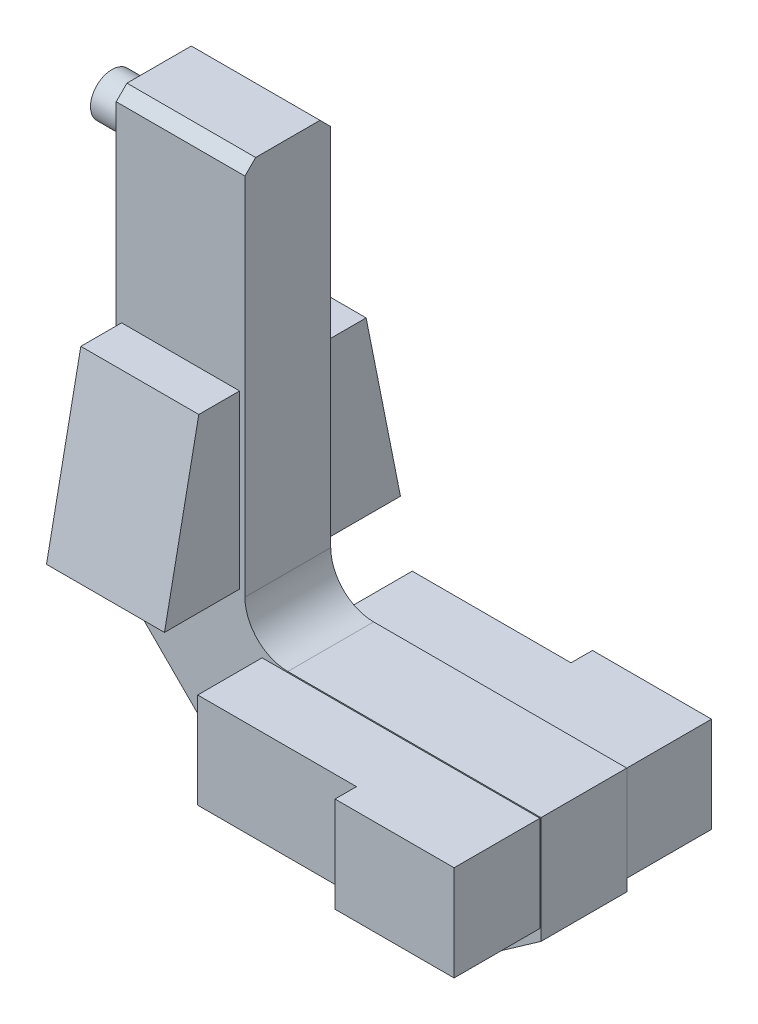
ISO-10303-21;
HEADER;
FILE_DESCRIPTION(('STEP AP214'),'2;1');
FILE_NAME('part.step','',(''),(''),'','','');
FILE_SCHEMA(('AUTOMOTIVE_DESIGN { 1 0 10303 214 1 1 1 1 }'));
ENDSEC;
DATA;
#1=APPLICATION_CONTEXT('core data for automotive mechanical design processes');
#2=APPLICATION_PROTOCOL_DEFINITION('international standard','automotive_design',2000,#1);
#3=PRODUCT_CONTEXT('',#1,'mechanical');
#4=PRODUCT('Part','Part','',(#3));
#5=PRODUCT_RELATED_PRODUCT_CATEGORY('part','',(#4));
#6=PRODUCT_DEFINITION_FORMATION('','',#4);
#7=PRODUCT_DEFINITION_CONTEXT('part definition',#1,'design');
#8=PRODUCT_DEFINITION('design','',#6,#7);
#9=PRODUCT_DEFINITION_SHAPE('','',#8);
#10=(LENGTH_UNIT() NAMED_UNIT(*) SI_UNIT(.MILLI.,.METRE.));
#11=(NAMED_UNIT(*) PLANE_ANGLE_UNIT() SI_UNIT($,.RADIAN.));
#12=(NAMED_UNIT(*) SI_UNIT($,.STERADIAN.) SOLID_ANGLE_UNIT());
#13=UNCERTAINTY_MEASURE_WITH_UNIT(LENGTH_MEASURE(1.E-05),#10,'distance_accuracy_value','');
#14=(GEOMETRIC_REPRESENTATION_CONTEXT(3) GLOBAL_UNCERTAINTY_ASSIGNED_CONTEXT((#13)) GLOBAL_UNIT_ASSIGNED_CONTEXT((#10,
#11,#12)) REPRESENTATION_CONTEXT('',''));
#15=CARTESIAN_POINT('',(0.,0.,0.));
#16=DIRECTION('',(0.,0.,1.));
#17=DIRECTION('',(1.,0.,0.));
#18=AXIS2_PLACEMENT_3D('',#15,#16,#17);
#19=CARTESIAN_POINT('',(0.,0.,20.));
#20=DIRECTION('',(0.,0.,1.));
#21=DIRECTION('',(1.,0.,0.));
#22=AXIS2_PLACEMENT_3D('',#19,#20,#21);
#23=PLANE('',#22);
#24=DIRECTION('',(0.,1.,0.));
#25=VECTOR('',#24,1.);
#26=CARTESIAN_POINT('',(57.5,72.,20.));
#27=LINE('',#26,#25);
#28=CARTESIAN_POINT('',(57.5,72.,20.));
#29=VERTEX_POINT('',#28);
#30=CARTESIAN_POINT('',(57.5,152.,20.));
#31=VERTEX_POINT('',#30);
#32=EDGE_CURVE('E319',#29,#31,#27,.T.);
#33=ORIENTED_EDGE('',*,*,#32,.F.);
#34=DIRECTION('',(1.,0.,0.));
#35=VECTOR('',#34,1.);
#36=CARTESIAN_POINT('',(2.50000000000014,72.,20.));
#37=LINE('',#36,#35);
#38=CARTESIAN_POINT('',(2.50000000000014,72.,20.));
#39=VERTEX_POINT('',#38);
#40=EDGE_CURVE('E312',#39,#29,#37,.T.);
#41=ORIENTED_EDGE('',*,*,#40,.F.);
#42=DIRECTION('',(0.,-1.,0.));
#43=VECTOR('',#42,1.);
#44=CARTESIAN_POINT('',(2.50000000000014,152.,20.));
#45=LINE('',#44,#43);
#46=CARTESIAN_POINT('',(2.50000000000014,152.,20.));
#47=VERTEX_POINT('',#46);
#48=EDGE_CURVE('E316',#47,#39,#45,.T.);
#49=ORIENTED_EDGE('',*,*,#48,.F.);
#50=DIRECTION('',(-1.,0.,0.));
#51=VECTOR('',#50,1.);
#52=CARTESIAN_POINT('',(57.5,152.,20.));
#53=LINE('',#52,#51);
#54=EDGE_CURVE('E322',#31,#47,#53,.T.);
#55=ORIENTED_EDGE('',*,*,#54,.F.);
#56=EDGE_LOOP('',(#33,#41,#49,#55));
#57=FACE_BOUND('',#56,.T.);
#58=DIRECTION('',(0.,-1.,0.));
#59=VECTOR('',#58,1.);
#60=CARTESIAN_POINT('',(0.,245.,20.));
#61=LINE('',#60,#59);
#62=CARTESIAN_POINT('',(0.,240.,20.));
#63=VERTEX_POINT('',#62);
#64=CARTESIAN_POINT('',(0.,50.,20.));
#65=VERTEX_POINT('',#64);
#66=EDGE_CURVE('E396',#63,#65,#61,.T.);
#67=ORIENTED_EDGE('',*,*,#66,.T.);
#68=DIRECTION('',(-0.707106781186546,0.707106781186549,0.));
#69=VECTOR('',#68,1.);
#70=CARTESIAN_POINT('',(25.,25.,20.));
#71=LINE('',#70,#69);
#72=CARTESIAN_POINT('',(50.,0.,20.));
#73=VERTEX_POINT('',#72);
#74=EDGE_CURVE('E11',#65,#73,#71,.F.);
#75=ORIENTED_EDGE('',*,*,#74,.T.);
#76=DIRECTION('',(1.,0.,0.));
#77=VECTOR('',#76,1.);
#78=CARTESIAN_POINT('',(0.,0.,20.));
#79=LINE('',#78,#77);
#80=CARTESIAN_POINT('',(144.,0.,20.));
#81=VERTEX_POINT('',#80);
#82=EDGE_CURVE('E392',#73,#81,#79,.T.);
#83=ORIENTED_EDGE('',*,*,#82,.T.);
#84=DIRECTION('',(0.,1.,0.));
#85=VECTOR('',#84,1.);
#86=CARTESIAN_POINT('',(144.,0.,20.));
#87=LINE('',#86,#85);
#88=CARTESIAN_POINT('',(144.,-20.,20.));
#89=VERTEX_POINT('',#88);
#90=EDGE_CURVE('E381',#89,#81,#87,.T.);
#91=ORIENTED_EDGE('',*,*,#90,.F.);
#92=DIRECTION('',(-1.,0.,0.));
#93=VECTOR('',#92,1.);
#94=CARTESIAN_POINT('',(144.,-20.,20.));
#95=LINE('',#94,#93);
#96=CARTESIAN_POINT('',(169.437039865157,-20.,20.));
#97=VERTEX_POINT('',#96);
#98=EDGE_CURVE('E365',#97,#89,#95,.T.);
#99=ORIENTED_EDGE('',*,*,#98,.F.);
#100=DIRECTION('',(-0.819152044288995,-0.573576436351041,0.));
#101=VECTOR('',#100,1.);
#102=CARTESIAN_POINT('',(169.437039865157,-20.,20.));
#103=LINE('',#102,#101);
#104=CARTESIAN_POINT('',(198.,0.,20.));
#105=VERTEX_POINT('',#104);
#106=EDGE_CURVE('E369',#105,#97,#103,.T.);
#107=ORIENTED_EDGE('',*,*,#106,.F.);
#108=DIRECTION('',(0.,1.,0.));
#109=VECTOR('',#108,1.);
#110=CARTESIAN_POINT('',(198.,0.,20.));
#111=LINE('',#110,#109);
#112=CARTESIAN_POINT('',(198.,50.,20.));
#113=VERTEX_POINT('',#112);
#114=EDGE_CURVE('E395',#105,#113,#111,.T.);
#115=ORIENTED_EDGE('',*,*,#114,.T.);
#116=DIRECTION('',(-1.,0.,0.));
#117=VECTOR('',#116,1.);
#118=CARTESIAN_POINT('',(198.,50.,20.));
#119=LINE('',#118,#117);
#120=CARTESIAN_POINT('',(80.,50.,20.));
#121=VERTEX_POINT('',#120);
#122=EDGE_CURVE('E405',#113,#121,#119,.T.);
#123=ORIENTED_EDGE('',*,*,#122,.T.);
#124=CARTESIAN_POINT('',(80.,70.,20.));
#125=DIRECTION('',(0.,0.,1.));
#126=DIRECTION('',(1.,0.,0.));
#127=AXIS2_PLACEMENT_3D('',#124,#125,#126);
#128=CIRCLE('',#127,20.);
#129=CARTESIAN_POINT('',(60.,70.,20.));
#130=VERTEX_POINT('',#129);
#131=EDGE_CURVE('E382',#121,#130,#128,.F.);
#132=ORIENTED_EDGE('',*,*,#131,.T.);
#133=DIRECTION('',(0.,1.,0.));
#134=VECTOR('',#133,1.);
#135=CARTESIAN_POINT('',(60.,50.,20.));
#136=LINE('',#135,#134);
#137=CARTESIAN_POINT('',(60.,240.,20.));
#138=VERTEX_POINT('',#137);
#139=EDGE_CURVE('E408',#130,#138,#136,.T.);
#140=ORIENTED_EDGE('',*,*,#139,.T.);
#141=DIRECTION('',(-1.,0.,0.));
#142=VECTOR('',#141,1.);
#143=CARTESIAN_POINT('',(0.,240.,20.));
#144=LINE('',#143,#142);
#145=EDGE_CURVE('E437',#138,#63,#144,.T.);
#146=ORIENTED_EDGE('',*,*,#145,.T.);
#147=EDGE_LOOP('',(#67,#75,#83,#91,#99,#107,#115,#123,#132,#140,#146));
#148=FACE_BOUND('',#147,.T.);
#149=DIRECTION('',(1.,0.,0.));
#150=VECTOR('',#149,1.);
#151=CARTESIAN_POINT('',(68.,4.99999999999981,20.));
#152=LINE('',#151,#150);
#153=CARTESIAN_POINT('',(68.,4.99999999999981,20.));
#154=VERTEX_POINT('',#153);
#155=CARTESIAN_POINT('',(197.5,4.9999999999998,20.));
#156=VERTEX_POINT('',#155);
#157=EDGE_CURVE('E850',#154,#156,#152,.T.);
#158=ORIENTED_EDGE('',*,*,#157,.F.);
#159=DIRECTION('',(0.,-1.,0.));
#160=VECTOR('',#159,1.);
#161=CARTESIAN_POINT('',(68.,49.5,20.));
#162=LINE('',#161,#160);
#163=CARTESIAN_POINT('',(68.,49.5,20.));
#164=VERTEX_POINT('',#163);
#165=EDGE_CURVE('E842',#164,#154,#162,.T.);
#166=ORIENTED_EDGE('',*,*,#165,.F.);
#167=DIRECTION('',(-1.,0.,0.));
#168=VECTOR('',#167,1.);
#169=CARTESIAN_POINT('',(197.5,49.5,20.));
#170=LINE('',#169,#168);
#171=CARTESIAN_POINT('',(197.5,49.5,20.));
#172=VERTEX_POINT('',#171);
#173=EDGE_CURVE('E253',#172,#164,#170,.T.);
#174=ORIENTED_EDGE('',*,*,#173,.F.);
#175=DIRECTION('',(0.,1.,0.));
#176=VECTOR('',#175,1.);
#177=CARTESIAN_POINT('',(197.5,4.9999999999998,20.));
#178=LINE('',#177,#176);
#179=EDGE_CURVE('E851',#156,#172,#178,.T.);
#180=ORIENTED_EDGE('',*,*,#179,.F.);
#181=EDGE_LOOP('',(#158,#166,#174,#180));
#182=FACE_BOUND('',#181,.T.);
#183=ADVANCED_FACE('F17',(#57,#148,#182),#23,.T.);
#184=CARTESIAN_POINT('',(0.,0.,-20.));
#185=DIRECTION('',(0.,0.,1.));
#186=DIRECTION('',(1.,0.,0.));
#187=AXIS2_PLACEMENT_3D('',#184,#185,#186);
#188=PLANE('',#187);
#189=DIRECTION('',(0.,1.,0.));
#190=VECTOR('',#189,1.);
#191=CARTESIAN_POINT('',(2.50000000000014,152.,-20.));
#192=LINE('',#191,#190);
#193=CARTESIAN_POINT('',(2.50000000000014,72.,-20.));
#194=VERTEX_POINT('',#193);
#195=CARTESIAN_POINT('',(2.50000000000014,152.,-20.));
#196=VERTEX_POINT('',#195);
#197=EDGE_CURVE('E334',#194,#196,#192,.T.);
#198=ORIENTED_EDGE('',*,*,#197,.F.);
#199=DIRECTION('',(-1.,0.,0.));
#200=VECTOR('',#199,1.);
#201=CARTESIAN_POINT('',(2.50000000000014,72.,-20.));
#202=LINE('',#201,#200);
#203=CARTESIAN_POINT('',(57.5,72.,-20.));
#204=VERTEX_POINT('',#203);
#205=EDGE_CURVE('E338',#204,#194,#202,.T.);
#206=ORIENTED_EDGE('',*,*,#205,.F.);
#207=DIRECTION('',(0.,-1.,0.));
#208=VECTOR('',#207,1.);
#209=CARTESIAN_POINT('',(57.5,72.,-20.));
#210=LINE('',#209,#208);
#211=CARTESIAN_POINT('',(57.5,152.,-20.));
#212=VERTEX_POINT('',#211);
#213=EDGE_CURVE('E344',#212,#204,#210,.T.);
#214=ORIENTED_EDGE('',*,*,#213,.F.);
#215=DIRECTION('',(1.,0.,0.));
#216=VECTOR('',#215,1.);
#217=CARTESIAN_POINT('',(57.5,152.,-20.));
#218=LINE('',#217,#216);
#219=EDGE_CURVE('E341',#196,#212,#218,.T.);
#220=ORIENTED_EDGE('',*,*,#219,.F.);
#221=EDGE_LOOP('',(#198,#206,#214,#220));
#222=FACE_BOUND('',#221,.T.);
#223=DIRECTION('',(1.,0.,0.));
#224=VECTOR('',#223,1.);
#225=CARTESIAN_POINT('',(0.,0.,-20.));
#226=LINE('',#225,#224);
#227=CARTESIAN_POINT('',(50.,0.,-20.));
#228=VERTEX_POINT('',#227);
#229=CARTESIAN_POINT('',(144.,0.,-20.));
#230=VERTEX_POINT('',#229);
#231=EDGE_CURVE('E397',#228,#230,#226,.T.);
#232=ORIENTED_EDGE('',*,*,#231,.F.);
#233=DIRECTION('',(0.707106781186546,-0.707106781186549,0.));
#234=VECTOR('',#233,1.);
#235=CARTESIAN_POINT('',(50.,0.,-20.));
#236=LINE('',#235,#234);
#237=CARTESIAN_POINT('',(0.,50.,-20.));
#238=VERTEX_POINT('',#237);
#239=EDGE_CURVE('E454',#228,#238,#236,.F.);
#240=ORIENTED_EDGE('',*,*,#239,.T.);
#241=DIRECTION('',(0.,-1.,0.));
#242=VECTOR('',#241,1.);
#243=CARTESIAN_POINT('',(0.,245.,-20.));
#244=LINE('',#243,#242);
#245=CARTESIAN_POINT('',(0.,240.,-20.));
#246=VERTEX_POINT('',#245);
#247=EDGE_CURVE('E467',#246,#238,#244,.T.);
#248=ORIENTED_EDGE('',*,*,#247,.F.);
#249=DIRECTION('',(1.,0.,0.));
#250=VECTOR('',#249,1.);
#251=CARTESIAN_POINT('',(0.,240.,-20.));
#252=LINE('',#251,#250);
#253=CARTESIAN_POINT('',(60.,240.,-20.));
#254=VERTEX_POINT('',#253);
#255=EDGE_CURVE('E429',#246,#254,#252,.T.);
#256=ORIENTED_EDGE('',*,*,#255,.T.);
#257=DIRECTION('',(0.,1.,0.));
#258=VECTOR('',#257,1.);
#259=CARTESIAN_POINT('',(60.,50.,-20.));
#260=LINE('',#259,#258);
#261=CARTESIAN_POINT('',(60.,70.,-20.));
#262=VERTEX_POINT('',#261);
#263=EDGE_CURVE('E472',#262,#254,#260,.T.);
#264=ORIENTED_EDGE('',*,*,#263,.F.);
#265=CARTESIAN_POINT('',(80.,70.,-20.));
#266=DIRECTION('',(0.,0.,1.));
#267=DIRECTION('',(1.,0.,0.));
#268=AXIS2_PLACEMENT_3D('',#265,#266,#267);
#269=CIRCLE('',#268,20.);
#270=CARTESIAN_POINT('',(80.,50.,-20.));
#271=VERTEX_POINT('',#270);
#272=EDGE_CURVE('E444',#262,#271,#269,.T.);
#273=ORIENTED_EDGE('',*,*,#272,.T.);
#274=DIRECTION('',(-1.,0.,0.));
#275=VECTOR('',#274,1.);
#276=CARTESIAN_POINT('',(198.,50.,-20.));
#277=LINE('',#276,#275);
#278=CARTESIAN_POINT('',(198.,50.,-20.));
#279=VERTEX_POINT('',#278);
#280=EDGE_CURVE('E480',#279,#271,#277,.T.);
#281=ORIENTED_EDGE('',*,*,#280,.F.);
#282=DIRECTION('',(0.,1.,0.));
#283=VECTOR('',#282,1.);
#284=CARTESIAN_POINT('',(198.,0.,-20.));
#285=LINE('',#284,#283);
#286=CARTESIAN_POINT('',(198.,0.,-20.));
#287=VERTEX_POINT('',#286);
#288=EDGE_CURVE('E478',#287,#279,#285,.T.);
#289=ORIENTED_EDGE('',*,*,#288,.F.);
#290=DIRECTION('',(-0.819152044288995,-0.573576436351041,0.));
#291=VECTOR('',#290,1.);
#292=CARTESIAN_POINT('',(169.437039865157,-20.,-20.));
#293=LINE('',#292,#291);
#294=CARTESIAN_POINT('',(169.437039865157,-20.,-20.));
#295=VERTEX_POINT('',#294);
#296=EDGE_CURVE('E358',#287,#295,#293,.T.);
#297=ORIENTED_EDGE('',*,*,#296,.T.);
#298=DIRECTION('',(-1.,0.,0.));
#299=VECTOR('',#298,1.);
#300=CARTESIAN_POINT('',(144.,-20.,-20.));
#301=LINE('',#300,#299);
#302=CARTESIAN_POINT('',(144.,-20.,-20.));
#303=VERTEX_POINT('',#302);
#304=EDGE_CURVE('E359',#295,#303,#301,.T.);
#305=ORIENTED_EDGE('',*,*,#304,.T.);
#306=DIRECTION('',(0.,1.,0.));
#307=VECTOR('',#306,1.);
#308=CARTESIAN_POINT('',(144.,0.,-20.));
#309=LINE('',#308,#307);
#310=EDGE_CURVE('E362',#303,#230,#309,.T.);
#311=ORIENTED_EDGE('',*,*,#310,.T.);
#312=EDGE_LOOP('',(#232,#240,#248,#256,#264,#273,#281,#289,#297,#305,#311));
#313=FACE_BOUND('',#312,.T.);
#314=DIRECTION('',(0.,-1.,0.));
#315=VECTOR('',#314,1.);
#316=CARTESIAN_POINT('',(197.5,4.9999999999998,-20.));
#317=LINE('',#316,#315);
#318=CARTESIAN_POINT('',(197.5,49.5,-20.));
#319=VERTEX_POINT('',#318);
#320=CARTESIAN_POINT('',(197.5,4.9999999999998,-20.));
#321=VERTEX_POINT('',#320);
#322=EDGE_CURVE('E269',#319,#321,#317,.T.);
#323=ORIENTED_EDGE('',*,*,#322,.F.);
#324=DIRECTION('',(1.,0.,0.));
#325=VECTOR('',#324,1.);
#326=CARTESIAN_POINT('',(197.5,49.5,-20.));
#327=LINE('',#326,#325);
#328=CARTESIAN_POINT('',(68.,49.5,-20.));
#329=VERTEX_POINT('',#328);
#330=EDGE_CURVE('E274',#329,#319,#327,.T.);
#331=ORIENTED_EDGE('',*,*,#330,.F.);
#332=DIRECTION('',(0.,1.,0.));
#333=VECTOR('',#332,1.);
#334=CARTESIAN_POINT('',(68.,49.5,-20.));
#335=LINE('',#334,#333);
#336=CARTESIAN_POINT('',(68.,4.99999999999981,-20.));
#337=VERTEX_POINT('',#336);
#338=EDGE_CURVE('E285',#337,#329,#335,.T.);
#339=ORIENTED_EDGE('',*,*,#338,.F.);
#340=DIRECTION('',(-1.,0.,0.));
#341=VECTOR('',#340,1.);
#342=CARTESIAN_POINT('',(68.,4.99999999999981,-20.));
#343=LINE('',#342,#341);
#344=EDGE_CURVE('E282',#321,#337,#343,.T.);
#345=ORIENTED_EDGE('',*,*,#344,.F.);
#346=EDGE_LOOP('',(#323,#331,#339,#345));
#347=FACE_BOUND('',#346,.T.);
#348=ADVANCED_FACE('F473',(#222,#313,#347),#188,.F.);
#349=CARTESIAN_POINT('',(0.,0.,20.));
#350=DIRECTION('',(0.,1.,0.));
#351=DIRECTION('',(0.,0.,1.));
#352=AXIS2_PLACEMENT_3D('',#349,#350,#351);
#353=PLANE('',#352);
#354=ORIENTED_EDGE('',*,*,#82,.F.);
#355=DIRECTION('',(0.,0.,-1.));
#356=VECTOR('',#355,1.);
#357=CARTESIAN_POINT('',(50.,0.,20.));
#358=LINE('',#357,#356);
#359=EDGE_CURVE('E449',#73,#228,#358,.T.);
#360=ORIENTED_EDGE('',*,*,#359,.T.);
#361=ORIENTED_EDGE('',*,*,#231,.T.);
#362=DIRECTION('',(0.,0.,-1.));
#363=VECTOR('',#362,1.);
#364=CARTESIAN_POINT('',(144.,0.,77.5847201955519));
#365=LINE('',#364,#363);
#366=EDGE_CURVE('E373',#81,#230,#365,.T.);
#367=ORIENTED_EDGE('',*,*,#366,.F.);
#368=EDGE_LOOP('',(#354,#360,#361,#367));
#369=FACE_BOUND('',#368,.T.);
#370=ADVANCED_FACE('F525',(#369),#353,.F.);
#371=CARTESIAN_POINT('',(0.,245.,20.));
#372=DIRECTION('',(1.,0.,0.));
#373=DIRECTION('',(0.,1.,0.));
#374=AXIS2_PLACEMENT_3D('',#371,#372,#373);
#375=PLANE('',#374);
#376=CARTESIAN_POINT('',(0.,222.,0.));
#377=DIRECTION('',(-1.,0.,0.));
#378=DIRECTION('',(0.,-1.,0.));
#379=AXIS2_PLACEMENT_3D('',#376,#377,#378);
#380=CIRCLE('',#379,10.);
#381=CARTESIAN_POINT('',(0.,212.,0.));
#382=VERTEX_POINT('',#381);
#383=EDGE_CURVE('E482',#382,#382,#380,.T.);
#384=ORIENTED_EDGE('',*,*,#383,.F.);
#385=EDGE_LOOP('',(#384));
#386=FACE_BOUND('',#385,.T.);
#387=ORIENTED_EDGE('',*,*,#247,.T.);
#388=DIRECTION('',(0.,0.,1.));
#389=VECTOR('',#388,1.);
#390=CARTESIAN_POINT('',(0.,50.,20.));
#391=LINE('',#390,#389);
#392=EDGE_CURVE('E25',#238,#65,#391,.T.);
#393=ORIENTED_EDGE('',*,*,#392,.T.);
#394=ORIENTED_EDGE('',*,*,#66,.F.);
#395=DIRECTION('',(0.,0.707106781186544,-0.707106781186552));
#396=VECTOR('',#395,1.);
#397=CARTESIAN_POINT('',(0.,240.,20.));
#398=LINE('',#397,#396);
#399=CARTESIAN_POINT('',(0.,245.,15.));
#400=VERTEX_POINT('',#399);
#401=EDGE_CURVE('E425',#63,#400,#398,.T.);
#402=ORIENTED_EDGE('',*,*,#401,.T.);
#403=DIRECTION('',(0.,0.,-1.));
#404=VECTOR('',#403,1.);
#405=CARTESIAN_POINT('',(0.,245.,20.));
#406=LINE('',#405,#404);
#407=CARTESIAN_POINT('',(0.,245.,-15.));
#408=VERTEX_POINT('',#407);
#409=EDGE_CURVE('E410',#400,#408,#406,.T.);
#410=ORIENTED_EDGE('',*,*,#409,.T.);
#411=DIRECTION('',(0.,0.707106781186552,0.707106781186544));
#412=VECTOR('',#411,1.);
#413=CARTESIAN_POINT('',(0.,245.,-15.));
#414=LINE('',#413,#412);
#415=EDGE_CURVE('E427',#408,#246,#414,.F.);
#416=ORIENTED_EDGE('',*,*,#415,.T.);
#417=EDGE_LOOP('',(#387,#393,#394,#402,#410,#416));
#418=FACE_BOUND('',#417,.T.);
#419=ADVANCED_FACE('F465',(#386,#418),#375,.F.);
#420=CARTESIAN_POINT('',(198.,0.,20.));
#421=DIRECTION('',(-1.,0.,0.));
#422=DIRECTION('',(0.,0.,1.));
#423=AXIS2_PLACEMENT_3D('',#420,#421,#422);
#424=PLANE('',#423);
#425=DIRECTION('',(0.,0.,-1.));
#426=VECTOR('',#425,1.);
#427=CARTESIAN_POINT('',(198.,0.,20.));
#428=LINE('',#427,#426);
#429=EDGE_CURVE('E418',#105,#287,#428,.T.);
#430=ORIENTED_EDGE('',*,*,#429,.T.);
#431=ORIENTED_EDGE('',*,*,#288,.T.);
#432=DIRECTION('',(0.,0.,-1.));
#433=VECTOR('',#432,1.);
#434=CARTESIAN_POINT('',(198.,50.,20.));
#435=LINE('',#434,#433);
#436=EDGE_CURVE('E416',#113,#279,#435,.T.);
#437=ORIENTED_EDGE('',*,*,#436,.F.);
#438=ORIENTED_EDGE('',*,*,#114,.F.);
#439=EDGE_LOOP('',(#430,#431,#437,#438));
#440=FACE_BOUND('',#439,.T.);
#441=ADVANCED_FACE('F513',(#440),#424,.F.);
#442=CARTESIAN_POINT('',(198.,50.,20.));
#443=DIRECTION('',(0.,-1.,0.));
#444=DIRECTION('',(1.,0.,0.));
#445=AXIS2_PLACEMENT_3D('',#442,#443,#444);
#446=PLANE('',#445);
#447=ORIENTED_EDGE('',*,*,#280,.T.);
#448=DIRECTION('',(0.,0.,-1.));
#449=VECTOR('',#448,1.);
#450=CARTESIAN_POINT('',(80.,50.,20.));
#451=LINE('',#450,#449);
#452=EDGE_CURVE('E443',#271,#121,#451,.F.);
#453=ORIENTED_EDGE('',*,*,#452,.T.);
#454=ORIENTED_EDGE('',*,*,#122,.F.);
#455=ORIENTED_EDGE('',*,*,#436,.T.);
#456=EDGE_LOOP('',(#447,#453,#454,#455));
#457=FACE_BOUND('',#456,.T.);
#458=ADVANCED_FACE('F508',(#457),#446,.F.);
#459=CARTESIAN_POINT('',(60.,50.,20.));
#460=DIRECTION('',(-1.,0.,0.));
#461=DIRECTION('',(0.,0.,1.));
#462=AXIS2_PLACEMENT_3D('',#459,#460,#461);
#463=PLANE('',#462);
#464=ORIENTED_EDGE('',*,*,#139,.F.);
#465=DIRECTION('',(0.,0.,-1.));
#466=VECTOR('',#465,1.);
#467=CARTESIAN_POINT('',(60.,70.,-20.));
#468=LINE('',#467,#466);
#469=EDGE_CURVE('E440',#130,#262,#468,.T.);
#470=ORIENTED_EDGE('',*,*,#469,.T.);
#471=ORIENTED_EDGE('',*,*,#263,.T.);
#472=DIRECTION('',(0.,-0.707106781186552,-0.707106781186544));
#473=VECTOR('',#472,1.);
#474=CARTESIAN_POINT('',(60.,245.,-15.));
#475=LINE('',#474,#473);
#476=CARTESIAN_POINT('',(60.,245.,-15.));
#477=VERTEX_POINT('',#476);
#478=EDGE_CURVE('E435',#254,#477,#475,.F.);
#479=ORIENTED_EDGE('',*,*,#478,.T.);
#480=DIRECTION('',(0.,0.,-1.));
#481=VECTOR('',#480,1.);
#482=CARTESIAN_POINT('',(60.,245.,20.));
#483=LINE('',#482,#481);
#484=CARTESIAN_POINT('',(60.,245.,15.));
#485=VERTEX_POINT('',#484);
#486=EDGE_CURVE('E413',#485,#477,#483,.T.);
#487=ORIENTED_EDGE('',*,*,#486,.F.);
#488=DIRECTION('',(0.,-0.707106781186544,0.707106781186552));
#489=VECTOR('',#488,1.);
#490=CARTESIAN_POINT('',(60.,240.,20.));
#491=LINE('',#490,#489);
#492=EDGE_CURVE('E432',#485,#138,#491,.T.);
#493=ORIENTED_EDGE('',*,*,#492,.T.);
#494=EDGE_LOOP('',(#464,#470,#471,#479,#487,#493));
#495=FACE_BOUND('',#494,.T.);
#496=ADVANCED_FACE('F489',(#495),#463,.F.);
#497=CARTESIAN_POINT('',(60.,245.,20.));
#498=DIRECTION('',(0.,-1.,0.));
#499=DIRECTION('',(0.,0.,-1.));
#500=AXIS2_PLACEMENT_3D('',#497,#498,#499);
#501=PLANE('',#500);
#502=ORIENTED_EDGE('',*,*,#486,.T.);
#503=DIRECTION('',(-1.,0.,0.));
#504=VECTOR('',#503,1.);
#505=CARTESIAN_POINT('',(60.,245.,-15.));
#506=LINE('',#505,#504);
#507=EDGE_CURVE('E422',#477,#408,#506,.T.);
#508=ORIENTED_EDGE('',*,*,#507,.T.);
#509=ORIENTED_EDGE('',*,*,#409,.F.);
#510=DIRECTION('',(1.,0.,0.));
#511=VECTOR('',#510,1.);
#512=CARTESIAN_POINT('',(60.,245.,15.));
#513=LINE('',#512,#511);
#514=EDGE_CURVE('E420',#400,#485,#513,.T.);
#515=ORIENTED_EDGE('',*,*,#514,.T.);
#516=EDGE_LOOP('',(#502,#508,#509,#515));
#517=FACE_BOUND('',#516,.T.);
#518=ADVANCED_FACE('F498',(#517),#501,.F.);
#519=CARTESIAN_POINT('',(60.,245.,-15.));
#520=DIRECTION('',(0.,-0.707106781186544,0.707106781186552));
#521=DIRECTION('',(0.,-0.707106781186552,-0.707106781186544));
#522=AXIS2_PLACEMENT_3D('',#519,#520,#521);
#523=PLANE('',#522);
#524=ORIENTED_EDGE('',*,*,#478,.F.);
#525=ORIENTED_EDGE('',*,*,#255,.F.);
#526=ORIENTED_EDGE('',*,*,#415,.F.);
#527=ORIENTED_EDGE('',*,*,#507,.F.);
#528=EDGE_LOOP('',(#524,#525,#526,#527));
#529=FACE_BOUND('',#528,.T.);
#530=ADVANCED_FACE('F495',(#529),#523,.F.);
#531=CARTESIAN_POINT('',(0.,240.,20.));
#532=DIRECTION('',(0.,0.707106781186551,0.707106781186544));
#533=DIRECTION('',(0.,-0.707106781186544,0.707106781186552));
#534=AXIS2_PLACEMENT_3D('',#531,#532,#533);
#535=PLANE('',#534);
#536=ORIENTED_EDGE('',*,*,#492,.F.);
#537=ORIENTED_EDGE('',*,*,#514,.F.);
#538=ORIENTED_EDGE('',*,*,#401,.F.);
#539=ORIENTED_EDGE('',*,*,#145,.F.);
#540=EDGE_LOOP('',(#536,#537,#538,#539));
#541=FACE_BOUND('',#540,.T.);
#542=ADVANCED_FACE('F502',(#541),#535,.T.);
#543=CARTESIAN_POINT('',(80.,70.,20.));
#544=DIRECTION('',(0.,0.,1.));
#545=DIRECTION('',(1.,0.,0.));
#546=AXIS2_PLACEMENT_3D('',#543,#544,#545);
#547=CYLINDRICAL_SURFACE('',#546,20.);
#548=ORIENTED_EDGE('',*,*,#131,.F.);
#549=ORIENTED_EDGE('',*,*,#452,.F.);
#550=ORIENTED_EDGE('',*,*,#272,.F.);
#551=ORIENTED_EDGE('',*,*,#469,.F.);
#552=EDGE_LOOP('',(#548,#549,#550,#551));
#553=FACE_BOUND('',#552,.T.);
#554=ADVANCED_FACE('F504',(#553),#547,.F.);
#555=CARTESIAN_POINT('',(144.,-20.,77.5847201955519));
#556=DIRECTION('',(0.,-1.,0.));
#557=DIRECTION('',(1.,0.,0.));
#558=AXIS2_PLACEMENT_3D('',#555,#556,#557);
#559=PLANE('',#558);
#560=DIRECTION('',(0.,0.,-1.));
#561=VECTOR('',#560,1.);
#562=CARTESIAN_POINT('',(169.437039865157,-20.,77.5847201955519));
#563=LINE('',#562,#561);
#564=EDGE_CURVE('E372',#97,#295,#563,.T.);
#565=ORIENTED_EDGE('',*,*,#564,.F.);
#566=ORIENTED_EDGE('',*,*,#98,.T.);
#567=DIRECTION('',(0.,0.,-1.));
#568=VECTOR('',#567,1.);
#569=CARTESIAN_POINT('',(144.,-20.,77.5847201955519));
#570=LINE('',#569,#568);
#571=EDGE_CURVE('E368',#89,#303,#570,.T.);
#572=ORIENTED_EDGE('',*,*,#571,.T.);
#573=ORIENTED_EDGE('',*,*,#304,.F.);
#574=EDGE_LOOP('',(#565,#566,#572,#573));
#575=FACE_BOUND('',#574,.T.);
#576=ADVANCED_FACE('F521',(#575),#559,.T.);
#577=CARTESIAN_POINT('',(144.,0.,77.5847201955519));
#578=DIRECTION('',(-1.,0.,0.));
#579=DIRECTION('',(0.,0.,1.));
#580=AXIS2_PLACEMENT_3D('',#577,#578,#579);
#581=PLANE('',#580);
#582=ORIENTED_EDGE('',*,*,#571,.F.);
#583=ORIENTED_EDGE('',*,*,#90,.T.);
#584=ORIENTED_EDGE('',*,*,#366,.T.);
#585=ORIENTED_EDGE('',*,*,#310,.F.);
#586=EDGE_LOOP('',(#582,#583,#584,#585));
#587=FACE_BOUND('',#586,.T.);
#588=ADVANCED_FACE('F524',(#587),#581,.T.);
#589=CARTESIAN_POINT('',(169.437039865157,-20.,77.5847201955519));
#590=DIRECTION('',(0.573576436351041,-0.819152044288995,0.));
#591=DIRECTION('',(0.819152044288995,0.573576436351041,0.));
#592=AXIS2_PLACEMENT_3D('',#589,#590,#591);
#593=PLANE('',#592);
#594=ORIENTED_EDGE('',*,*,#429,.F.);
#595=ORIENTED_EDGE('',*,*,#106,.T.);
#596=ORIENTED_EDGE('',*,*,#564,.T.);
#597=ORIENTED_EDGE('',*,*,#296,.F.);
#598=EDGE_LOOP('',(#594,#595,#596,#597));
#599=FACE_BOUND('',#598,.T.);
#600=ADVANCED_FACE('F517',(#599),#593,.T.);
#601=CARTESIAN_POINT('',(50.,0.,20.));
#602=DIRECTION('',(0.707106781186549,0.707106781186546,0.));
#603=DIRECTION('',(-0.707106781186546,0.707106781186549,0.));
#604=AXIS2_PLACEMENT_3D('',#601,#602,#603);
#605=PLANE('',#604);
#606=ORIENTED_EDGE('',*,*,#74,.F.);
#607=ORIENTED_EDGE('',*,*,#392,.F.);
#608=ORIENTED_EDGE('',*,*,#239,.F.);
#609=ORIENTED_EDGE('',*,*,#359,.F.);
#610=EDGE_LOOP('',(#606,#607,#608,#609));
#611=FACE_BOUND('',#610,.T.);
#612=ADVANCED_FACE('F19',(#611),#605,.F.);
#613=CARTESIAN_POINT('',(2.50000000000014,152.,-55.));
#614=DIRECTION('',(1.,0.,0.));
#615=DIRECTION('',(0.,0.,-1.));
#616=AXIS2_PLACEMENT_3D('',#613,#614,#615);
#617=PLANE('',#616);
#618=DIRECTION('',(0.,0.,1.));
#619=VECTOR('',#618,1.);
#620=CARTESIAN_POINT('',(2.50000000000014,152.,-55.));
#621=LINE('',#620,#619);
#622=CARTESIAN_POINT('',(2.50000000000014,152.,-39.));
#623=VERTEX_POINT('',#622);
#624=EDGE_CURVE('E356',#623,#196,#621,.T.);
#625=ORIENTED_EDGE('',*,*,#624,.F.);
#626=DIRECTION('',(0.,0.98058067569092,0.196116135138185));
#627=VECTOR('',#626,1.);
#628=CARTESIAN_POINT('',(2.50000000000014,152.,-39.));
#629=LINE('',#628,#627);
#630=CARTESIAN_POINT('',(2.50000000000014,72.,-55.));
#631=VERTEX_POINT('',#630);
#632=EDGE_CURVE('E307',#631,#623,#629,.T.);
#633=ORIENTED_EDGE('',*,*,#632,.F.);
#634=DIRECTION('',(0.,0.,1.));
#635=VECTOR('',#634,1.);
#636=CARTESIAN_POINT('',(2.50000000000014,72.,-55.));
#637=LINE('',#636,#635);
#638=EDGE_CURVE('E337',#631,#194,#637,.T.);
#639=ORIENTED_EDGE('',*,*,#638,.T.);
#640=ORIENTED_EDGE('',*,*,#197,.T.);
#641=EDGE_LOOP('',(#625,#633,#639,#640));
#642=FACE_BOUND('',#641,.T.);
#643=ADVANCED_FACE('F616',(#642),#617,.F.);
#644=CARTESIAN_POINT('',(57.5,152.,-55.));
#645=DIRECTION('',(0.,-1.,0.));
#646=DIRECTION('',(0.,0.,-1.));
#647=AXIS2_PLACEMENT_3D('',#644,#645,#646);
#648=PLANE('',#647);
#649=DIRECTION('',(0.,0.,1.));
#650=VECTOR('',#649,1.);
#651=CARTESIAN_POINT('',(57.5,152.,-55.));
#652=LINE('',#651,#650);
#653=CARTESIAN_POINT('',(57.5,152.,-39.));
#654=VERTEX_POINT('',#653);
#655=EDGE_CURVE('E354',#654,#212,#652,.T.);
#656=ORIENTED_EDGE('',*,*,#655,.F.);
#657=DIRECTION('',(-1.,0.,0.));
#658=VECTOR('',#657,1.);
#659=CARTESIAN_POINT('',(198.001,152.,-39.));
#660=LINE('',#659,#658);
#661=EDGE_CURVE('E309',#654,#623,#660,.T.);
#662=ORIENTED_EDGE('',*,*,#661,.T.);
#663=ORIENTED_EDGE('',*,*,#624,.T.);
#664=ORIENTED_EDGE('',*,*,#219,.T.);
#665=EDGE_LOOP('',(#656,#662,#663,#664));
#666=FACE_BOUND('',#665,.T.);
#667=ADVANCED_FACE('F622',(#666),#648,.F.);
#668=CARTESIAN_POINT('',(57.5,72.,-55.));
#669=DIRECTION('',(-1.,0.,0.));
#670=DIRECTION('',(0.,0.,1.));
#671=AXIS2_PLACEMENT_3D('',#668,#669,#670);
#672=PLANE('',#671);
#673=DIRECTION('',(0.,0.,1.));
#674=VECTOR('',#673,1.);
#675=CARTESIAN_POINT('',(57.5,72.,-55.));
#676=LINE('',#675,#674);
#677=CARTESIAN_POINT('',(57.5,72.,-55.));
#678=VERTEX_POINT('',#677);
#679=EDGE_CURVE('E351',#678,#204,#676,.T.);
#680=ORIENTED_EDGE('',*,*,#679,.F.);
#681=DIRECTION('',(0.,-0.98058067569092,-0.196116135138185));
#682=VECTOR('',#681,1.);
#683=CARTESIAN_POINT('',(57.5,152.,-39.));
#684=LINE('',#683,#682);
#685=EDGE_CURVE('E305',#654,#678,#684,.T.);
#686=ORIENTED_EDGE('',*,*,#685,.F.);
#687=ORIENTED_EDGE('',*,*,#655,.T.);
#688=ORIENTED_EDGE('',*,*,#213,.T.);
#689=EDGE_LOOP('',(#680,#686,#687,#688));
#690=FACE_BOUND('',#689,.T.);
#691=ADVANCED_FACE('F630',(#690),#672,.F.);
#692=CARTESIAN_POINT('',(2.50000000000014,72.,-55.));
#693=DIRECTION('',(0.,1.,0.));
#694=DIRECTION('',(0.,0.,1.));
#695=AXIS2_PLACEMENT_3D('',#692,#693,#694);
#696=PLANE('',#695);
#697=ORIENTED_EDGE('',*,*,#205,.T.);
#698=ORIENTED_EDGE('',*,*,#638,.F.);
#699=DIRECTION('',(-1.,0.,0.));
#700=VECTOR('',#699,1.);
#701=CARTESIAN_POINT('',(2.50000000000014,72.,-55.));
#702=LINE('',#701,#700);
#703=EDGE_CURVE('E335',#678,#631,#702,.T.);
#704=ORIENTED_EDGE('',*,*,#703,.F.);
#705=ORIENTED_EDGE('',*,*,#679,.T.);
#706=EDGE_LOOP('',(#697,#698,#704,#705));
#707=FACE_BOUND('',#706,.T.);
#708=ADVANCED_FACE('F638',(#707),#696,.F.);
#709=CARTESIAN_POINT('',(2.50000000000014,72.,55.));
#710=DIRECTION('',(0.,1.,0.));
#711=DIRECTION('',(0.,0.,1.));
#712=AXIS2_PLACEMENT_3D('',#709,#710,#711);
#713=PLANE('',#712);
#714=ORIENTED_EDGE('',*,*,#40,.T.);
#715=DIRECTION('',(0.,0.,-1.));
#716=VECTOR('',#715,1.);
#717=CARTESIAN_POINT('',(57.5,72.,55.));
#718=LINE('',#717,#716);
#719=CARTESIAN_POINT('',(57.5,72.,55.));
#720=VERTEX_POINT('',#719);
#721=EDGE_CURVE('E332',#720,#29,#718,.T.);
#722=ORIENTED_EDGE('',*,*,#721,.F.);
#723=DIRECTION('',(1.,0.,0.));
#724=VECTOR('',#723,1.);
#725=CARTESIAN_POINT('',(2.50000000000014,72.,55.));
#726=LINE('',#725,#724);
#727=CARTESIAN_POINT('',(2.50000000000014,72.,55.));
#728=VERTEX_POINT('',#727);
#729=EDGE_CURVE('E313',#728,#720,#726,.T.);
#730=ORIENTED_EDGE('',*,*,#729,.F.);
#731=DIRECTION('',(0.,0.,-1.));
#732=VECTOR('',#731,1.);
#733=CARTESIAN_POINT('',(2.50000000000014,72.,55.));
#734=LINE('',#733,#732);
#735=EDGE_CURVE('E315',#728,#39,#734,.T.);
#736=ORIENTED_EDGE('',*,*,#735,.T.);
#737=EDGE_LOOP('',(#714,#722,#730,#736));
#738=FACE_BOUND('',#737,.T.);
#739=ADVANCED_FACE('F646',(#738),#713,.F.);
#740=CARTESIAN_POINT('',(57.5,72.,55.));
#741=DIRECTION('',(-1.,0.,0.));
#742=DIRECTION('',(0.,0.,1.));
#743=AXIS2_PLACEMENT_3D('',#740,#741,#742);
#744=PLANE('',#743);
#745=DIRECTION('',(0.,0.,-1.));
#746=VECTOR('',#745,1.);
#747=CARTESIAN_POINT('',(57.5,152.,55.));
#748=LINE('',#747,#746);
#749=CARTESIAN_POINT('',(57.5,152.,39.));
#750=VERTEX_POINT('',#749);
#751=EDGE_CURVE('E330',#750,#31,#748,.T.);
#752=ORIENTED_EDGE('',*,*,#751,.F.);
#753=DIRECTION('',(0.,0.98058067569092,-0.196116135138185));
#754=VECTOR('',#753,1.);
#755=CARTESIAN_POINT('',(57.5,152.,39.));
#756=LINE('',#755,#754);
#757=EDGE_CURVE('E299',#720,#750,#756,.T.);
#758=ORIENTED_EDGE('',*,*,#757,.F.);
#759=ORIENTED_EDGE('',*,*,#721,.T.);
#760=ORIENTED_EDGE('',*,*,#32,.T.);
#761=EDGE_LOOP('',(#752,#758,#759,#760));
#762=FACE_BOUND('',#761,.T.);
#763=ADVANCED_FACE('F654',(#762),#744,.F.);
#764=CARTESIAN_POINT('',(57.5,152.,55.));
#765=DIRECTION('',(0.,-1.,0.));
#766=DIRECTION('',(0.,0.,-1.));
#767=AXIS2_PLACEMENT_3D('',#764,#765,#766);
#768=PLANE('',#767);
#769=DIRECTION('',(0.,0.,-1.));
#770=VECTOR('',#769,1.);
#771=CARTESIAN_POINT('',(2.50000000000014,152.,55.));
#772=LINE('',#771,#770);
#773=CARTESIAN_POINT('',(2.50000000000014,152.,39.));
#774=VERTEX_POINT('',#773);
#775=EDGE_CURVE('E328',#774,#47,#772,.T.);
#776=ORIENTED_EDGE('',*,*,#775,.F.);
#777=DIRECTION('',(-1.,0.,0.));
#778=VECTOR('',#777,1.);
#779=CARTESIAN_POINT('',(198.001,152.,39.));
#780=LINE('',#779,#778);
#781=EDGE_CURVE('E303',#750,#774,#780,.T.);
#782=ORIENTED_EDGE('',*,*,#781,.F.);
#783=ORIENTED_EDGE('',*,*,#751,.T.);
#784=ORIENTED_EDGE('',*,*,#54,.T.);
#785=EDGE_LOOP('',(#776,#782,#783,#784));
#786=FACE_BOUND('',#785,.T.);
#787=ADVANCED_FACE('F662',(#786),#768,.F.);
#788=CARTESIAN_POINT('',(2.50000000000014,152.,55.));
#789=DIRECTION('',(1.,0.,0.));
#790=DIRECTION('',(0.,0.,-1.));
#791=AXIS2_PLACEMENT_3D('',#788,#789,#790);
#792=PLANE('',#791);
#793=ORIENTED_EDGE('',*,*,#735,.F.);
#794=DIRECTION('',(0.,-0.98058067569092,0.196116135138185));
#795=VECTOR('',#794,1.);
#796=CARTESIAN_POINT('',(2.50000000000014,152.,39.));
#797=LINE('',#796,#795);
#798=EDGE_CURVE('E301',#774,#728,#797,.T.);
#799=ORIENTED_EDGE('',*,*,#798,.F.);
#800=ORIENTED_EDGE('',*,*,#775,.T.);
#801=ORIENTED_EDGE('',*,*,#48,.T.);
#802=EDGE_LOOP('',(#793,#799,#800,#801));
#803=FACE_BOUND('',#802,.T.);
#804=ADVANCED_FACE('F670',(#803),#792,.F.);
#805=CARTESIAN_POINT('',(198.001,152.,-39.));
#806=DIRECTION('',(0.,-0.196116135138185,0.98058067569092));
#807=DIRECTION('',(0.,-0.98058067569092,-0.196116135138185));
#808=AXIS2_PLACEMENT_3D('',#805,#806,#807);
#809=PLANE('',#808);
#810=ORIENTED_EDGE('',*,*,#685,.T.);
#811=ORIENTED_EDGE('',*,*,#703,.T.);
#812=ORIENTED_EDGE('',*,*,#632,.T.);
#813=ORIENTED_EDGE('',*,*,#661,.F.);
#814=EDGE_LOOP('',(#810,#811,#812,#813));
#815=FACE_BOUND('',#814,.T.);
#816=ADVANCED_FACE('F678',(#815),#809,.F.);
#817=CARTESIAN_POINT('',(198.001,152.,39.));
#818=DIRECTION('',(0.,-0.196116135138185,-0.98058067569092));
#819=DIRECTION('',(0.,0.98058067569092,-0.196116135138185));
#820=AXIS2_PLACEMENT_3D('',#817,#818,#819);
#821=PLANE('',#820);
#822=ORIENTED_EDGE('',*,*,#757,.T.);
#823=ORIENTED_EDGE('',*,*,#781,.T.);
#824=ORIENTED_EDGE('',*,*,#798,.T.);
#825=ORIENTED_EDGE('',*,*,#729,.T.);
#826=EDGE_LOOP('',(#822,#823,#824,#825));
#827=FACE_BOUND('',#826,.T.);
#828=ADVANCED_FACE('F686',(#827),#821,.F.);
#829=CARTESIAN_POINT('',(197.5,4.9999999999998,-60.));
#830=DIRECTION('',(-1.,0.,0.));
#831=DIRECTION('',(0.,0.,1.));
#832=AXIS2_PLACEMENT_3D('',#829,#830,#831);
#833=PLANE('',#832);
#834=ORIENTED_EDGE('',*,*,#322,.T.);
#835=DIRECTION('',(0.,0.,1.));
#836=VECTOR('',#835,1.);
#837=CARTESIAN_POINT('',(197.5,4.9999999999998,-60.));
#838=LINE('',#837,#836);
#839=CARTESIAN_POINT('',(197.5,4.9999999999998,-60.));
#840=VERTEX_POINT('',#839);
#841=EDGE_CURVE('E296',#840,#321,#838,.T.);
#842=ORIENTED_EDGE('',*,*,#841,.F.);
#843=DIRECTION('',(0.,-1.,0.));
#844=VECTOR('',#843,1.);
#845=CARTESIAN_POINT('',(197.5,4.9999999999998,-60.));
#846=LINE('',#845,#844);
#847=CARTESIAN_POINT('',(197.5,49.5,-60.));
#848=VERTEX_POINT('',#847);
#849=EDGE_CURVE('E270',#848,#840,#846,.T.);
#850=ORIENTED_EDGE('',*,*,#849,.F.);
#851=DIRECTION('',(0.,0.,1.));
#852=VECTOR('',#851,1.);
#853=CARTESIAN_POINT('',(197.5,49.5,-60.));
#854=LINE('',#853,#852);
#855=EDGE_CURVE('E279',#848,#319,#854,.T.);
#856=ORIENTED_EDGE('',*,*,#855,.T.);
#857=EDGE_LOOP('',(#834,#842,#850,#856));
#858=FACE_BOUND('',#857,.T.);
#859=ADVANCED_FACE('F694',(#858),#833,.F.);
#860=CARTESIAN_POINT('',(68.,4.99999999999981,-60.));
#861=DIRECTION('',(0.,1.,0.));
#862=DIRECTION('',(-1.,0.,0.));
#863=AXIS2_PLACEMENT_3D('',#860,#861,#862);
#864=PLANE('',#863);
#865=DIRECTION('',(0.,0.,1.));
#866=VECTOR('',#865,1.);
#867=CARTESIAN_POINT('',(68.,4.99999999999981,-60.));
#868=LINE('',#867,#866);
#869=CARTESIAN_POINT('',(68.,4.99999999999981,-50.));
#870=VERTEX_POINT('',#869);
#871=EDGE_CURVE('E294',#870,#337,#868,.T.);
#872=ORIENTED_EDGE('',*,*,#871,.F.);
#873=DIRECTION('',(-1.,0.,0.));
#874=VECTOR('',#873,1.);
#875=CARTESIAN_POINT('',(68.,4.99999999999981,-50.));
#876=LINE('',#875,#874);
#877=CARTESIAN_POINT('',(142.,4.9999999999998,-50.));
#878=VERTEX_POINT('',#877);
#879=EDGE_CURVE('E836',#878,#870,#876,.T.);
#880=ORIENTED_EDGE('',*,*,#879,.F.);
#881=DIRECTION('',(0.,0.,1.));
#882=VECTOR('',#881,1.);
#883=CARTESIAN_POINT('',(142.,4.9999999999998,-60.));
#884=LINE('',#883,#882);
#885=CARTESIAN_POINT('',(142.,4.9999999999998,-60.));
#886=VERTEX_POINT('',#885);
#887=EDGE_CURVE('E833',#886,#878,#884,.T.);
#888=ORIENTED_EDGE('',*,*,#887,.F.);
#889=DIRECTION('',(-1.,0.,0.));
#890=VECTOR('',#889,1.);
#891=CARTESIAN_POINT('',(68.,4.99999999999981,-60.));
#892=LINE('',#891,#890);
#893=EDGE_CURVE('E273',#840,#886,#892,.T.);
#894=ORIENTED_EDGE('',*,*,#893,.F.);
#895=ORIENTED_EDGE('',*,*,#841,.T.);
#896=ORIENTED_EDGE('',*,*,#344,.T.);
#897=EDGE_LOOP('',(#872,#880,#888,#894,#895,#896));
#898=FACE_BOUND('',#897,.T.);
#899=ADVANCED_FACE('F702',(#898),#864,.F.);
#900=CARTESIAN_POINT('',(68.,49.5,-60.));
#901=DIRECTION('',(1.,0.,0.));
#902=DIRECTION('',(0.,0.,-1.));
#903=AXIS2_PLACEMENT_3D('',#900,#901,#902);
#904=PLANE('',#903);
#905=DIRECTION('',(0.,0.,1.));
#906=VECTOR('',#905,1.);
#907=CARTESIAN_POINT('',(68.,49.5,-60.));
#908=LINE('',#907,#906);
#909=CARTESIAN_POINT('',(68.,49.5,-50.));
#910=VERTEX_POINT('',#909);
#911=EDGE_CURVE('E292',#910,#329,#908,.T.);
#912=ORIENTED_EDGE('',*,*,#911,.F.);
#913=DIRECTION('',(0.,-1.,0.));
#914=VECTOR('',#913,1.);
#915=CARTESIAN_POINT('',(68.,245.001,-50.));
#916=LINE('',#915,#914);
#917=EDGE_CURVE('E839',#910,#870,#916,.T.);
#918=ORIENTED_EDGE('',*,*,#917,.T.);
#919=ORIENTED_EDGE('',*,*,#871,.T.);
#920=ORIENTED_EDGE('',*,*,#338,.T.);
#921=EDGE_LOOP('',(#912,#918,#919,#920));
#922=FACE_BOUND('',#921,.T.);
#923=ADVANCED_FACE('F710',(#922),#904,.F.);
#924=CARTESIAN_POINT('',(197.5,49.5,-60.));
#925=DIRECTION('',(0.,-1.,0.));
#926=DIRECTION('',(0.,0.,-1.));
#927=AXIS2_PLACEMENT_3D('',#924,#925,#926);
#928=PLANE('',#927);
#929=DIRECTION('',(0.,0.,-1.));
#930=VECTOR('',#929,1.);
#931=CARTESIAN_POINT('',(142.,49.5,-60.));
#932=LINE('',#931,#930);
#933=CARTESIAN_POINT('',(142.,49.5,-50.));
#934=VERTEX_POINT('',#933);
#935=CARTESIAN_POINT('',(142.,49.5,-60.));
#936=VERTEX_POINT('',#935);
#937=EDGE_CURVE('E40',#934,#936,#932,.T.);
#938=ORIENTED_EDGE('',*,*,#937,.F.);
#939=DIRECTION('',(1.,0.,0.));
#940=VECTOR('',#939,1.);
#941=CARTESIAN_POINT('',(68.,49.5,-50.));
#942=LINE('',#941,#940);
#943=EDGE_CURVE('E830',#910,#934,#942,.T.);
#944=ORIENTED_EDGE('',*,*,#943,.F.);
#945=ORIENTED_EDGE('',*,*,#911,.T.);
#946=ORIENTED_EDGE('',*,*,#330,.T.);
#947=ORIENTED_EDGE('',*,*,#855,.F.);
#948=DIRECTION('',(1.,0.,0.));
#949=VECTOR('',#948,1.);
#950=CARTESIAN_POINT('',(197.5,49.5,-60.));
#951=LINE('',#950,#949);
#952=EDGE_CURVE('E277',#936,#848,#951,.T.);
#953=ORIENTED_EDGE('',*,*,#952,.F.);
#954=EDGE_LOOP('',(#938,#944,#945,#946,#947,#953));
#955=FACE_BOUND('',#954,.T.);
#956=ADVANCED_FACE('F718',(#955),#928,.F.);
#957=CARTESIAN_POINT('',(197.5,49.5,-60.));
#958=DIRECTION('',(0.,0.,1.));
#959=DIRECTION('',(1.,0.,0.));
#960=AXIS2_PLACEMENT_3D('',#957,#958,#959);
#961=PLANE('',#960);
#962=ORIENTED_EDGE('',*,*,#893,.T.);
#963=DIRECTION('',(0.,-1.,0.));
#964=VECTOR('',#963,1.);
#965=CARTESIAN_POINT('',(142.,245.001,-60.));
#966=LINE('',#965,#964);
#967=EDGE_CURVE('E838',#936,#886,#966,.T.);
#968=ORIENTED_EDGE('',*,*,#967,.F.);
#969=ORIENTED_EDGE('',*,*,#952,.T.);
#970=ORIENTED_EDGE('',*,*,#849,.T.);
#971=EDGE_LOOP('',(#962,#968,#969,#970));
#972=FACE_BOUND('',#971,.T.);
#973=ADVANCED_FACE('F726',(#972),#961,.F.);
#974=CARTESIAN_POINT('',(68.,49.5,60.));
#975=DIRECTION('',(1.,0.,0.));
#976=DIRECTION('',(0.,0.,-1.));
#977=AXIS2_PLACEMENT_3D('',#974,#975,#976);
#978=PLANE('',#977);
#979=DIRECTION('',(0.,0.,-1.));
#980=VECTOR('',#979,1.);
#981=CARTESIAN_POINT('',(68.,4.99999999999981,60.));
#982=LINE('',#981,#980);
#983=CARTESIAN_POINT('',(68.,4.99999999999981,50.));
#984=VERTEX_POINT('',#983);
#985=EDGE_CURVE('E249',#984,#154,#982,.T.);
#986=ORIENTED_EDGE('',*,*,#985,.F.);
#987=DIRECTION('',(0.,-1.,0.));
#988=VECTOR('',#987,1.);
#989=CARTESIAN_POINT('',(68.,245.001,50.));
#990=LINE('',#989,#988);
#991=CARTESIAN_POINT('',(68.,49.5,50.));
#992=VERTEX_POINT('',#991);
#993=EDGE_CURVE('E234',#992,#984,#990,.T.);
#994=ORIENTED_EDGE('',*,*,#993,.F.);
#995=DIRECTION('',(0.,0.,-1.));
#996=VECTOR('',#995,1.);
#997=CARTESIAN_POINT('',(68.,49.5,60.));
#998=LINE('',#997,#996);
#999=EDGE_CURVE('E247',#992,#164,#998,.T.);
#1000=ORIENTED_EDGE('',*,*,#999,.T.);
#1001=ORIENTED_EDGE('',*,*,#165,.T.);
#1002=EDGE_LOOP('',(#986,#994,#1000,#1001));
#1003=FACE_BOUND('',#1002,.T.);
#1004=ADVANCED_FACE('F245',(#1003),#978,.F.);
#1005=CARTESIAN_POINT('',(68.,4.99999999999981,60.));
#1006=DIRECTION('',(0.,1.,0.));
#1007=DIRECTION('',(-1.,0.,0.));
#1008=AXIS2_PLACEMENT_3D('',#1005,#1006,#1007);
#1009=PLANE('',#1008);
#1010=DIRECTION('',(1.,0.,0.));
#1011=VECTOR('',#1010,1.);
#1012=CARTESIAN_POINT('',(68.,4.99999999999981,60.));
#1013=LINE('',#1012,#1011);
#1014=CARTESIAN_POINT('',(142.,4.9999999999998,60.));
#1015=VERTEX_POINT('',#1014);
#1016=CARTESIAN_POINT('',(197.5,4.9999999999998,60.));
#1017=VERTEX_POINT('',#1016);
#1018=EDGE_CURVE('E846',#1015,#1017,#1013,.T.);
#1019=ORIENTED_EDGE('',*,*,#1018,.F.);
#1020=DIRECTION('',(0.,0.,1.));
#1021=VECTOR('',#1020,1.);
#1022=CARTESIAN_POINT('',(142.,4.9999999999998,60.));
#1023=LINE('',#1022,#1021);
#1024=CARTESIAN_POINT('',(142.,4.9999999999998,50.));
#1025=VERTEX_POINT('',#1024);
#1026=EDGE_CURVE('E32',#1025,#1015,#1023,.T.);
#1027=ORIENTED_EDGE('',*,*,#1026,.F.);
#1028=DIRECTION('',(1.,0.,0.));
#1029=VECTOR('',#1028,1.);
#1030=CARTESIAN_POINT('',(68.,4.99999999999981,50.));
#1031=LINE('',#1030,#1029);
#1032=EDGE_CURVE('E822',#984,#1025,#1031,.T.);
#1033=ORIENTED_EDGE('',*,*,#1032,.F.);
#1034=ORIENTED_EDGE('',*,*,#985,.T.);
#1035=ORIENTED_EDGE('',*,*,#157,.T.);
#1036=DIRECTION('',(0.,0.,-1.));
#1037=VECTOR('',#1036,1.);
#1038=CARTESIAN_POINT('',(197.5,4.9999999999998,60.));
#1039=LINE('',#1038,#1037);
#1040=EDGE_CURVE('E258',#1017,#156,#1039,.T.);
#1041=ORIENTED_EDGE('',*,*,#1040,.F.);
#1042=EDGE_LOOP('',(#1019,#1027,#1033,#1034,#1035,#1041));
#1043=FACE_BOUND('',#1042,.T.);
#1044=ADVANCED_FACE('F741',(#1043),#1009,.F.);
#1045=CARTESIAN_POINT('',(197.5,4.9999999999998,60.));
#1046=DIRECTION('',(-1.,0.,0.));
#1047=DIRECTION('',(0.,0.,1.));
#1048=AXIS2_PLACEMENT_3D('',#1045,#1046,#1047);
#1049=PLANE('',#1048);
#1050=ORIENTED_EDGE('',*,*,#179,.T.);
#1051=DIRECTION('',(0.,0.,-1.));
#1052=VECTOR('',#1051,1.);
#1053=CARTESIAN_POINT('',(197.5,49.5,60.));
#1054=LINE('',#1053,#1052);
#1055=CARTESIAN_POINT('',(197.5,49.5,60.));
#1056=VERTEX_POINT('',#1055);
#1057=EDGE_CURVE('E255',#1056,#172,#1054,.T.);
#1058=ORIENTED_EDGE('',*,*,#1057,.F.);
#1059=DIRECTION('',(0.,1.,0.));
#1060=VECTOR('',#1059,1.);
#1061=CARTESIAN_POINT('',(197.5,4.9999999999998,60.));
#1062=LINE('',#1061,#1060);
#1063=EDGE_CURVE('E261',#1017,#1056,#1062,.T.);
#1064=ORIENTED_EDGE('',*,*,#1063,.F.);
#1065=ORIENTED_EDGE('',*,*,#1040,.T.);
#1066=EDGE_LOOP('',(#1050,#1058,#1064,#1065));
#1067=FACE_BOUND('',#1066,.T.);
#1068=ADVANCED_FACE('F748',(#1067),#1049,.F.);
#1069=CARTESIAN_POINT('',(197.5,49.5,60.));
#1070=DIRECTION('',(0.,-1.,0.));
#1071=DIRECTION('',(0.,0.,-1.));
#1072=AXIS2_PLACEMENT_3D('',#1069,#1070,#1071);
#1073=PLANE('',#1072);
#1074=DIRECTION('',(-1.,0.,0.));
#1075=VECTOR('',#1074,1.);
#1076=CARTESIAN_POINT('',(68.,49.5,50.));
#1077=LINE('',#1076,#1075);
#1078=CARTESIAN_POINT('',(142.,49.5,50.));
#1079=VERTEX_POINT('',#1078);
#1080=EDGE_CURVE('E230',#1079,#992,#1077,.T.);
#1081=ORIENTED_EDGE('',*,*,#1080,.F.);
#1082=DIRECTION('',(0.,0.,-1.));
#1083=VECTOR('',#1082,1.);
#1084=CARTESIAN_POINT('',(142.,49.5,60.));
#1085=LINE('',#1084,#1083);
#1086=CARTESIAN_POINT('',(142.,49.5,60.));
#1087=VERTEX_POINT('',#1086);
#1088=EDGE_CURVE('E820',#1087,#1079,#1085,.T.);
#1089=ORIENTED_EDGE('',*,*,#1088,.F.);
#1090=DIRECTION('',(-1.,0.,0.));
#1091=VECTOR('',#1090,1.);
#1092=CARTESIAN_POINT('',(197.5,49.5,60.));
#1093=LINE('',#1092,#1091);
#1094=EDGE_CURVE('E256',#1056,#1087,#1093,.T.);
#1095=ORIENTED_EDGE('',*,*,#1094,.F.);
#1096=ORIENTED_EDGE('',*,*,#1057,.T.);
#1097=ORIENTED_EDGE('',*,*,#173,.T.);
#1098=ORIENTED_EDGE('',*,*,#999,.F.);
#1099=EDGE_LOOP('',(#1081,#1089,#1095,#1096,#1097,#1098));
#1100=FACE_BOUND('',#1099,.T.);
#1101=ADVANCED_FACE('F251',(#1100),#1073,.F.);
#1102=CARTESIAN_POINT('',(68.,49.5,60.));
#1103=DIRECTION('',(0.,0.,-1.));
#1104=DIRECTION('',(-1.,0.,0.));
#1105=AXIS2_PLACEMENT_3D('',#1102,#1103,#1104);
#1106=PLANE('',#1105);
#1107=ORIENTED_EDGE('',*,*,#1094,.T.);
#1108=DIRECTION('',(0.,-1.,0.));
#1109=VECTOR('',#1108,1.);
#1110=CARTESIAN_POINT('',(142.,245.001,60.));
#1111=LINE('',#1110,#1109);
#1112=EDGE_CURVE('E241',#1087,#1015,#1111,.T.);
#1113=ORIENTED_EDGE('',*,*,#1112,.T.);
#1114=ORIENTED_EDGE('',*,*,#1018,.T.);
#1115=ORIENTED_EDGE('',*,*,#1063,.T.);
#1116=EDGE_LOOP('',(#1107,#1113,#1114,#1115));
#1117=FACE_BOUND('',#1116,.T.);
#1118=ADVANCED_FACE('F763',(#1117),#1106,.F.);
#1119=CARTESIAN_POINT('',(68.,245.001,-50.));
#1120=DIRECTION('',(0.,0.,1.));
#1121=DIRECTION('',(1.,0.,0.));
#1122=AXIS2_PLACEMENT_3D('',#1119,#1120,#1121);
#1123=PLANE('',#1122);
#1124=ORIENTED_EDGE('',*,*,#943,.T.);
#1125=DIRECTION('',(0.,-1.,0.));
#1126=VECTOR('',#1125,1.);
#1127=CARTESIAN_POINT('',(142.,245.001,-50.));
#1128=LINE('',#1127,#1126);
#1129=EDGE_CURVE('E843',#934,#878,#1128,.T.);
#1130=ORIENTED_EDGE('',*,*,#1129,.T.);
#1131=ORIENTED_EDGE('',*,*,#879,.T.);
#1132=ORIENTED_EDGE('',*,*,#917,.F.);
#1133=EDGE_LOOP('',(#1124,#1130,#1131,#1132));
#1134=FACE_BOUND('',#1133,.T.);
#1135=ADVANCED_FACE('F770',(#1134),#1123,.F.);
#1136=CARTESIAN_POINT('',(142.,245.001,-60.));
#1137=DIRECTION('',(1.,0.,0.));
#1138=DIRECTION('',(0.,1.,0.));
#1139=AXIS2_PLACEMENT_3D('',#1136,#1137,#1138);
#1140=PLANE('',#1139);
#1141=ORIENTED_EDGE('',*,*,#937,.T.);
#1142=ORIENTED_EDGE('',*,*,#967,.T.);
#1143=ORIENTED_EDGE('',*,*,#887,.T.);
#1144=ORIENTED_EDGE('',*,*,#1129,.F.);
#1145=EDGE_LOOP('',(#1141,#1142,#1143,#1144));
#1146=FACE_BOUND('',#1145,.T.);
#1147=ADVANCED_FACE('F778',(#1146),#1140,.F.);
#1148=CARTESIAN_POINT('',(142.,245.001,60.));
#1149=DIRECTION('',(1.,0.,0.));
#1150=DIRECTION('',(0.,1.,0.));
#1151=AXIS2_PLACEMENT_3D('',#1148,#1149,#1150);
#1152=PLANE('',#1151);
#1153=ORIENTED_EDGE('',*,*,#1088,.T.);
#1154=DIRECTION('',(0.,-1.,0.));
#1155=VECTOR('',#1154,1.);
#1156=CARTESIAN_POINT('',(142.,245.001,50.));
#1157=LINE('',#1156,#1155);
#1158=EDGE_CURVE('E236',#1079,#1025,#1157,.T.);
#1159=ORIENTED_EDGE('',*,*,#1158,.T.);
#1160=ORIENTED_EDGE('',*,*,#1026,.T.);
#1161=ORIENTED_EDGE('',*,*,#1112,.F.);
#1162=EDGE_LOOP('',(#1153,#1159,#1160,#1161));
#1163=FACE_BOUND('',#1162,.T.);
#1164=ADVANCED_FACE('F786',(#1163),#1152,.F.);
#1165=CARTESIAN_POINT('',(68.,245.001,50.));
#1166=DIRECTION('',(0.,0.,-1.));
#1167=DIRECTION('',(-1.,0.,0.));
#1168=AXIS2_PLACEMENT_3D('',#1165,#1166,#1167);
#1169=PLANE('',#1168);
#1170=ORIENTED_EDGE('',*,*,#1080,.T.);
#1171=ORIENTED_EDGE('',*,*,#993,.T.);
#1172=ORIENTED_EDGE('',*,*,#1032,.T.);
#1173=ORIENTED_EDGE('',*,*,#1158,.F.);
#1174=EDGE_LOOP('',(#1170,#1171,#1172,#1173));
#1175=FACE_BOUND('',#1174,.T.);
#1176=ADVANCED_FACE('F232',(#1175),#1169,.F.);
#1177=CARTESIAN_POINT('',(-22.,222.,0.));
#1178=DIRECTION('',(1.,0.,0.));
#1179=DIRECTION('',(0.,1.,0.));
#1180=AXIS2_PLACEMENT_3D('',#1177,#1178,#1179);
#1181=CYLINDRICAL_SURFACE('',#1180,10.);
#1182=CARTESIAN_POINT('',(-22.,222.,0.));
#1183=DIRECTION('',(-1.,0.,0.));
#1184=DIRECTION('',(0.,-1.,0.));
#1185=AXIS2_PLACEMENT_3D('',#1182,#1183,#1184);
#1186=CIRCLE('',#1185,10.);
#1187=CARTESIAN_POINT('',(-22.,212.,0.));
#1188=VERTEX_POINT('',#1187);
#1189=EDGE_CURVE('E819',#1188,#1188,#1186,.T.);
#1190=ORIENTED_EDGE('',*,*,#1189,.F.);
#1191=EDGE_LOOP('',(#1190));
#1192=FACE_BOUND('',#1191,.T.);
#1193=ORIENTED_EDGE('',*,*,#383,.T.);
#1194=EDGE_LOOP('',(#1193));
#1195=FACE_BOUND('',#1194,.T.);
#1196=ADVANCED_FACE('F799',(#1192,#1195),#1181,.T.);
#1197=CARTESIAN_POINT('',(-22.,222.,0.));
#1198=DIRECTION('',(-1.,0.,0.));
#1199=DIRECTION('',(0.,-1.,0.));
#1200=AXIS2_PLACEMENT_3D('',#1197,#1198,#1199);
#1201=PLANE('',#1200);
#1202=ORIENTED_EDGE('',*,*,#1189,.T.);
#1203=EDGE_LOOP('',(#1202));
#1204=FACE_BOUND('',#1203,.T.);
#1205=ADVANCED_FACE('F806',(#1204),#1201,.T.);
#1206=CLOSED_SHELL('',(#183,#348,#370,#419,#441,#458,#496,#518,#530,#542,#554,#576,#588,#600,
#612,#643,#667,#691,#708,#739,#763,#787,#804,#816,#828,#859,#899,#923,#956,#973,#1004,#1044,
#1068,#1101,#1118,#1135,#1147,#1164,#1176,#1196,#1205));
#1207=MANIFOLD_SOLID_BREP('B1',#1206);
#1208=ADVANCED_BREP_SHAPE_REPRESENTATION('',(#18,#1207),#14);
#1209=SHAPE_DEFINITION_REPRESENTATION(#9,#1208);
ENDSEC;
END-ISO-10303-21;
